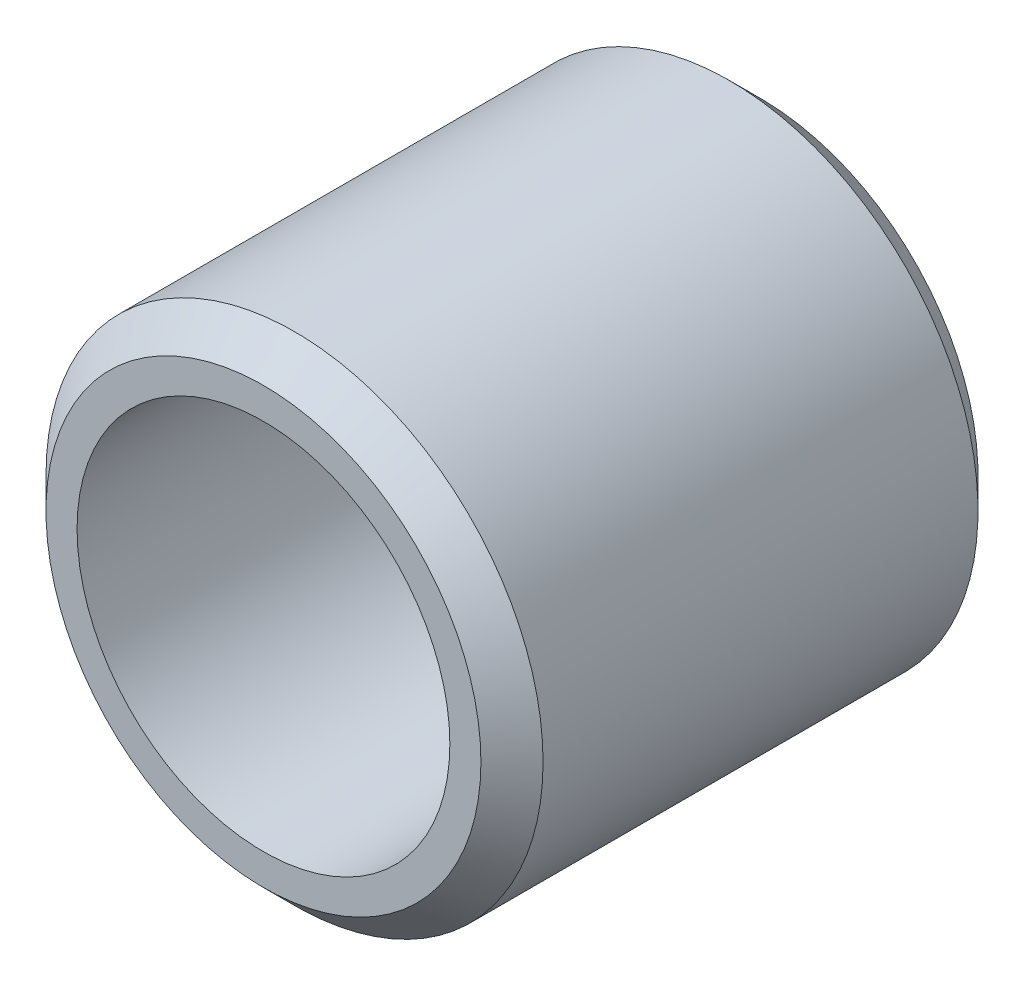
ISO-10303-21;
HEADER;
FILE_DESCRIPTION(('STEP AP214'),'2;1');
FILE_NAME('part.step','',(''),(''),'','','');
FILE_SCHEMA(('AUTOMOTIVE_DESIGN { 1 0 10303 214 1 1 1 1 }'));
ENDSEC;
DATA;
#1=APPLICATION_CONTEXT('core data for automotive mechanical design processes');
#2=APPLICATION_PROTOCOL_DEFINITION('international standard','automotive_design',2000,#1);
#3=PRODUCT_CONTEXT('',#1,'mechanical');
#4=PRODUCT('Part','Part','',(#3));
#5=PRODUCT_RELATED_PRODUCT_CATEGORY('part','',(#4));
#6=PRODUCT_DEFINITION_FORMATION('','',#4);
#7=PRODUCT_DEFINITION_CONTEXT('part definition',#1,'design');
#8=PRODUCT_DEFINITION('design','',#6,#7);
#9=PRODUCT_DEFINITION_SHAPE('','',#8);
#10=(LENGTH_UNIT() NAMED_UNIT(*) SI_UNIT(.MILLI.,.METRE.));
#11=(NAMED_UNIT(*) PLANE_ANGLE_UNIT() SI_UNIT($,.RADIAN.));
#12=(NAMED_UNIT(*) SI_UNIT($,.STERADIAN.) SOLID_ANGLE_UNIT());
#13=UNCERTAINTY_MEASURE_WITH_UNIT(LENGTH_MEASURE(1.E-05),#10,'distance_accuracy_value','');
#14=(GEOMETRIC_REPRESENTATION_CONTEXT(3) GLOBAL_UNCERTAINTY_ASSIGNED_CONTEXT((#13)) GLOBAL_UNIT_ASSIGNED_CONTEXT((#10,
#11,#12)) REPRESENTATION_CONTEXT('',''));
#15=CARTESIAN_POINT('',(0.,0.,0.));
#16=DIRECTION('',(0.,0.,1.));
#17=DIRECTION('',(1.,0.,0.));
#18=AXIS2_PLACEMENT_3D('',#15,#16,#17);
#19=CARTESIAN_POINT('',(0.,0.,0.));
#20=DIRECTION('',(0.,0.,-1.));
#21=DIRECTION('',(-1.,0.,0.));
#22=AXIS2_PLACEMENT_3D('',#19,#20,#21);
#23=CYLINDRICAL_SURFACE('',#22,6.);
#24=CARTESIAN_POINT('',(0.,0.,0.));
#25=DIRECTION('',(0.,0.,-1.));
#26=DIRECTION('',(-1.,0.,0.));
#27=AXIS2_PLACEMENT_3D('',#24,#25,#26);
#28=CIRCLE('',#27,6.);
#29=CARTESIAN_POINT('',(-6.,0.,0.));
#30=VERTEX_POINT('',#29);
#31=EDGE_CURVE('E34',#30,#30,#28,.T.);
#32=ORIENTED_EDGE('',*,*,#31,.T.);
#33=EDGE_LOOP('',(#32));
#34=FACE_BOUND('',#33,.T.);
#35=CARTESIAN_POINT('',(0.,0.,16.));
#36=DIRECTION('',(0.,0.,-1.));
#37=DIRECTION('',(-1.,0.,0.));
#38=AXIS2_PLACEMENT_3D('',#35,#36,#37);
#39=CIRCLE('',#38,6.);
#40=CARTESIAN_POINT('',(-6.,0.,16.));
#41=VERTEX_POINT('',#40);
#42=EDGE_CURVE('E31',#41,#41,#39,.T.);
#43=ORIENTED_EDGE('',*,*,#42,.F.);
#44=EDGE_LOOP('',(#43));
#45=FACE_BOUND('',#44,.T.);
#46=ADVANCED_FACE('F12',(#34,#45),#23,.F.);
#47=CARTESIAN_POINT('',(-6.,0.,16.));
#48=DIRECTION('',(0.,0.,1.));
#49=DIRECTION('',(1.,0.,0.));
#50=AXIS2_PLACEMENT_3D('',#47,#48,#49);
#51=PLANE('',#50);
#52=CARTESIAN_POINT('',(0.,0.,16.));
#53=DIRECTION('',(0.,0.,1.));
#54=DIRECTION('',(1.,0.,0.));
#55=AXIS2_PLACEMENT_3D('',#52,#53,#54);
#56=CIRCLE('',#55,7.);
#57=CARTESIAN_POINT('',(7.,0.,16.));
#58=VERTEX_POINT('',#57);
#59=EDGE_CURVE('E8',#58,#58,#56,.T.);
#60=ORIENTED_EDGE('',*,*,#59,.T.);
#61=EDGE_LOOP('',(#60));
#62=FACE_BOUND('',#61,.T.);
#63=ORIENTED_EDGE('',*,*,#42,.T.);
#64=EDGE_LOOP('',(#63));
#65=FACE_BOUND('',#64,.T.);
#66=ADVANCED_FACE('F55',(#62,#65),#51,.T.);
#67=CARTESIAN_POINT('',(0.,0.,0.));
#68=DIRECTION('',(0.,0.,-1.));
#69=DIRECTION('',(-1.,0.,0.));
#70=AXIS2_PLACEMENT_3D('',#67,#68,#69);
#71=CYLINDRICAL_SURFACE('',#70,8.);
#72=CARTESIAN_POINT('',(0.,0.,0.999999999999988));
#73=DIRECTION('',(0.,0.,-1.));
#74=DIRECTION('',(-1.,0.,0.));
#75=AXIS2_PLACEMENT_3D('',#72,#73,#74);
#76=CIRCLE('',#75,8.);
#77=CARTESIAN_POINT('',(-8.,0.,0.999999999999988));
#78=VERTEX_POINT('',#77);
#79=EDGE_CURVE('E18',#78,#78,#76,.F.);
#80=ORIENTED_EDGE('',*,*,#79,.T.);
#81=EDGE_LOOP('',(#80));
#82=FACE_BOUND('',#81,.T.);
#83=CARTESIAN_POINT('',(0.,0.,15.));
#84=DIRECTION('',(0.,0.,1.));
#85=DIRECTION('',(1.,0.,0.));
#86=AXIS2_PLACEMENT_3D('',#83,#84,#85);
#87=CIRCLE('',#86,8.);
#88=CARTESIAN_POINT('',(8.,0.,15.));
#89=VERTEX_POINT('',#88);
#90=EDGE_CURVE('E22',#89,#89,#87,.F.);
#91=ORIENTED_EDGE('',*,*,#90,.T.);
#92=EDGE_LOOP('',(#91));
#93=FACE_BOUND('',#92,.T.);
#94=ADVANCED_FACE('F43',(#82,#93),#71,.T.);
#95=CARTESIAN_POINT('',(-6.,0.,0.));
#96=DIRECTION('',(0.,0.,-1.));
#97=DIRECTION('',(-1.,0.,0.));
#98=AXIS2_PLACEMENT_3D('',#95,#96,#97);
#99=PLANE('',#98);
#100=CARTESIAN_POINT('',(0.,0.,0.));
#101=DIRECTION('',(0.,0.,-1.));
#102=DIRECTION('',(-1.,0.,0.));
#103=AXIS2_PLACEMENT_3D('',#100,#101,#102);
#104=CIRCLE('',#103,7.);
#105=CARTESIAN_POINT('',(-7.,0.,0.));
#106=VERTEX_POINT('',#105);
#107=EDGE_CURVE('E26',#106,#106,#104,.T.);
#108=ORIENTED_EDGE('',*,*,#107,.T.);
#109=EDGE_LOOP('',(#108));
#110=FACE_BOUND('',#109,.T.);
#111=ORIENTED_EDGE('',*,*,#31,.F.);
#112=EDGE_LOOP('',(#111));
#113=FACE_BOUND('',#112,.T.);
#114=ADVANCED_FACE('F40',(#110,#113),#99,.T.);
#115=CARTESIAN_POINT('',(0.,0.,0.));
#116=DIRECTION('',(0.,0.,1.));
#117=DIRECTION('',(1.,0.,0.));
#118=AXIS2_PLACEMENT_3D('',#115,#116,#117);
#119=CONICAL_SURFACE('',#118,7.,0.785398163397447);
#120=ORIENTED_EDGE('',*,*,#79,.F.);
#121=EDGE_LOOP('',(#120));
#122=FACE_BOUND('',#121,.T.);
#123=ORIENTED_EDGE('',*,*,#107,.F.);
#124=EDGE_LOOP('',(#123));
#125=FACE_BOUND('',#124,.T.);
#126=ADVANCED_FACE('F42',(#122,#125),#119,.T.);
#127=CARTESIAN_POINT('',(0.,0.,15.));
#128=DIRECTION('',(0.,0.,-1.));
#129=DIRECTION('',(-1.,0.,0.));
#130=AXIS2_PLACEMENT_3D('',#127,#128,#129);
#131=CONICAL_SURFACE('',#130,8.,0.785398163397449);
#132=ORIENTED_EDGE('',*,*,#59,.F.);
#133=EDGE_LOOP('',(#132));
#134=FACE_BOUND('',#133,.T.);
#135=ORIENTED_EDGE('',*,*,#90,.F.);
#136=EDGE_LOOP('',(#135));
#137=FACE_BOUND('',#136,.T.);
#138=ADVANCED_FACE('F52',(#134,#137),#131,.T.);
#139=CLOSED_SHELL('',(#46,#66,#94,#114,#126,#138));
#140=MANIFOLD_SOLID_BREP('B1',#139);
#141=ADVANCED_BREP_SHAPE_REPRESENTATION('',(#18,#140),#14);
#142=SHAPE_DEFINITION_REPRESENTATION(#9,#141);
ENDSEC;
END-ISO-10303-21;
